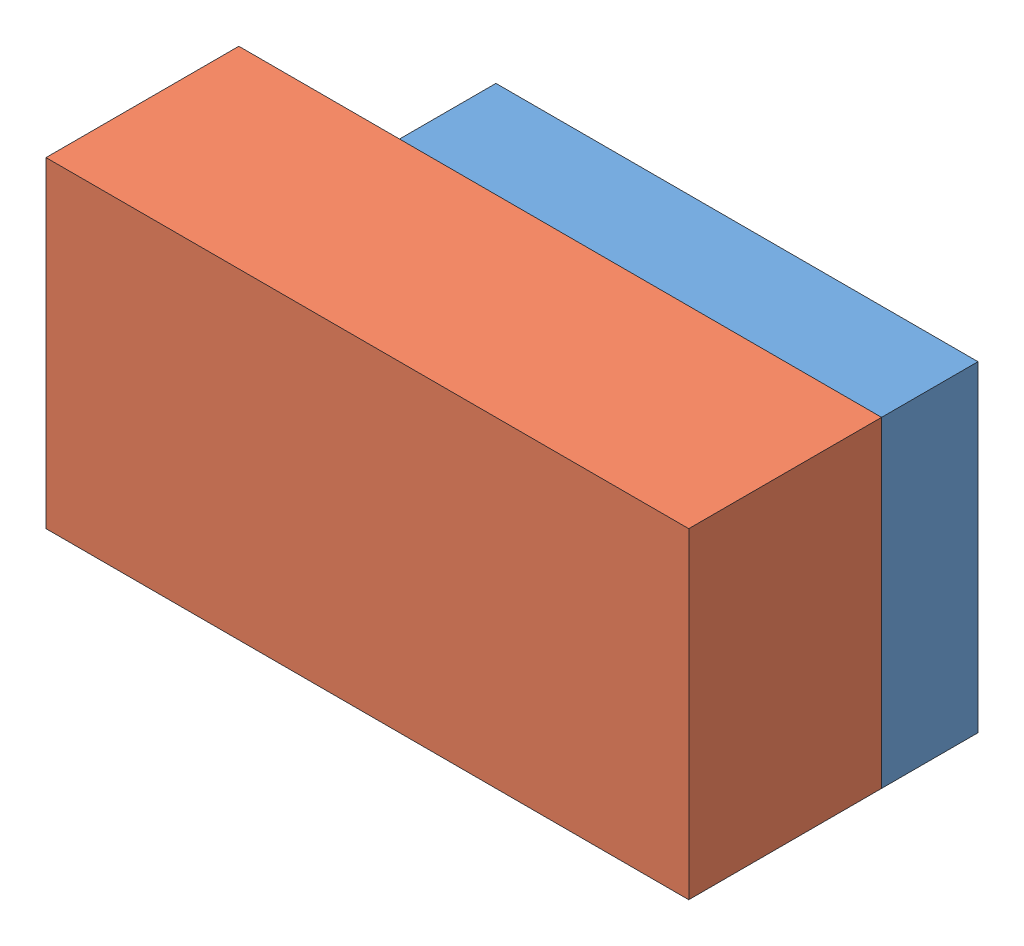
SolidWorks assembly TestBG.SLDASM, configuration Standard (file format 5000). Lengths in mm.
Overall size (100 50 45).
2 component instances, 2 part files, 3 mates.
Components (placement in the parent):
- Klotz2-1: Klotz2.SLDPRT [Standard] at origin size (75 50 15)
- Klotz1-1: Klotz1.SLDPRT [Standard] at (-12.5 0 22.5) size (100 50 30)
Mates (geometry in assembly coordinates):
- Deckungsgleich1: coincident: plane of Klotz2-1 through (37.5 50 7.5) normal (1 0 0); plane of Klotz1-1 through (37.5 50 37.5) normal (1 0 0)
- Deckungsgleich2: coincident: plane of Klotz2-1 through (0 0 0) normal (0 -1 0); plane of Klotz1-1 through (-12.5 0 22.5) normal (0 -1 0)
- Deckungsgleich3: coincident anti-aligned: plane of Klotz2-1 through (37.5 50 7.5) normal (0 0 1); plane of Klotz1-1 through (37.5 50 7.5) normal (0 0 -1)
